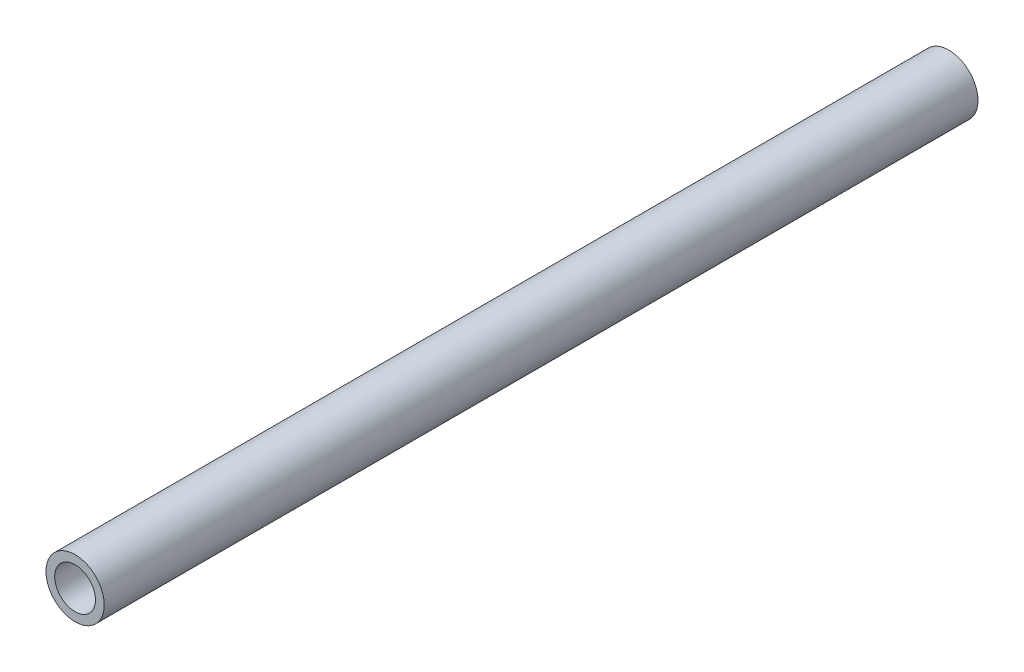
ISO-10303-21;
HEADER;
FILE_DESCRIPTION(('STEP AP214'),'2;1');
FILE_NAME('part.step','',(''),(''),'','','');
FILE_SCHEMA(('AUTOMOTIVE_DESIGN { 1 0 10303 214 1 1 1 1 }'));
ENDSEC;
DATA;
#1=APPLICATION_CONTEXT('core data for automotive mechanical design processes');
#2=APPLICATION_PROTOCOL_DEFINITION('international standard','automotive_design',2000,#1);
#3=PRODUCT_CONTEXT('',#1,'mechanical');
#4=PRODUCT('Part','Part','',(#3));
#5=PRODUCT_RELATED_PRODUCT_CATEGORY('part','',(#4));
#6=PRODUCT_DEFINITION_FORMATION('','',#4);
#7=PRODUCT_DEFINITION_CONTEXT('part definition',#1,'design');
#8=PRODUCT_DEFINITION('design','',#6,#7);
#9=PRODUCT_DEFINITION_SHAPE('','',#8);
#10=(LENGTH_UNIT() NAMED_UNIT(*) SI_UNIT(.MILLI.,.METRE.));
#11=(NAMED_UNIT(*) PLANE_ANGLE_UNIT() SI_UNIT($,.RADIAN.));
#12=(NAMED_UNIT(*) SI_UNIT($,.STERADIAN.) SOLID_ANGLE_UNIT());
#13=UNCERTAINTY_MEASURE_WITH_UNIT(LENGTH_MEASURE(1.E-05),#10,'distance_accuracy_value','');
#14=(GEOMETRIC_REPRESENTATION_CONTEXT(3) GLOBAL_UNCERTAINTY_ASSIGNED_CONTEXT((#13)) GLOBAL_UNIT_ASSIGNED_CONTEXT((#10,
#11,#12)) REPRESENTATION_CONTEXT('',''));
#15=CARTESIAN_POINT('',(0.,0.,0.));
#16=DIRECTION('',(0.,0.,1.));
#17=DIRECTION('',(1.,0.,0.));
#18=AXIS2_PLACEMENT_3D('',#15,#16,#17);
#19=CARTESIAN_POINT('',(0.,0.,300.));
#20=DIRECTION('',(0.,0.,1.));
#21=DIRECTION('',(1.,0.,0.));
#22=AXIS2_PLACEMENT_3D('',#19,#20,#21);
#23=PLANE('',#22);
#24=CARTESIAN_POINT('',(0.,0.,300.));
#25=DIRECTION('',(0.,0.,1.));
#26=DIRECTION('',(1.,0.,0.));
#27=AXIS2_PLACEMENT_3D('',#24,#25,#26);
#28=CIRCLE('',#27,10.);
#29=CARTESIAN_POINT('',(10.,0.,300.));
#30=VERTEX_POINT('',#29);
#31=EDGE_CURVE('E10',#30,#30,#28,.T.);
#32=ORIENTED_EDGE('',*,*,#31,.T.);
#33=EDGE_LOOP('',(#32));
#34=FACE_BOUND('',#33,.T.);
#35=CARTESIAN_POINT('',(0.,0.,300.));
#36=DIRECTION('',(0.,0.,1.));
#37=DIRECTION('',(1.,0.,0.));
#38=AXIS2_PLACEMENT_3D('',#35,#36,#37);
#39=CIRCLE('',#38,7.);
#40=CARTESIAN_POINT('',(7.,0.,300.));
#41=VERTEX_POINT('',#40);
#42=EDGE_CURVE('E46',#41,#41,#39,.T.);
#43=ORIENTED_EDGE('',*,*,#42,.F.);
#44=EDGE_LOOP('',(#43));
#45=FACE_BOUND('',#44,.T.);
#46=ADVANCED_FACE('F35',(#34,#45),#23,.T.);
#47=CARTESIAN_POINT('',(0.,0.,0.));
#48=DIRECTION('',(0.,0.,1.));
#49=DIRECTION('',(1.,0.,0.));
#50=AXIS2_PLACEMENT_3D('',#47,#48,#49);
#51=PLANE('',#50);
#52=CARTESIAN_POINT('',(0.,0.,0.));
#53=DIRECTION('',(0.,0.,1.));
#54=DIRECTION('',(1.,0.,0.));
#55=AXIS2_PLACEMENT_3D('',#52,#53,#54);
#56=CIRCLE('',#55,10.);
#57=CARTESIAN_POINT('',(10.,0.,0.));
#58=VERTEX_POINT('',#57);
#59=EDGE_CURVE('E39',#58,#58,#56,.T.);
#60=ORIENTED_EDGE('',*,*,#59,.F.);
#61=EDGE_LOOP('',(#60));
#62=FACE_BOUND('',#61,.T.);
#63=CARTESIAN_POINT('',(0.,0.,0.));
#64=DIRECTION('',(0.,0.,1.));
#65=DIRECTION('',(1.,0.,0.));
#66=AXIS2_PLACEMENT_3D('',#63,#64,#65);
#67=CIRCLE('',#66,7.);
#68=CARTESIAN_POINT('',(7.,0.,0.));
#69=VERTEX_POINT('',#68);
#70=EDGE_CURVE('E48',#69,#69,#67,.T.);
#71=ORIENTED_EDGE('',*,*,#70,.T.);
#72=EDGE_LOOP('',(#71));
#73=FACE_BOUND('',#72,.T.);
#74=ADVANCED_FACE('F58',(#62,#73),#51,.F.);
#75=CARTESIAN_POINT('',(0.,0.,300.));
#76=DIRECTION('',(0.,0.,-1.));
#77=DIRECTION('',(-1.,0.,0.));
#78=AXIS2_PLACEMENT_3D('',#75,#76,#77);
#79=CYLINDRICAL_SURFACE('',#78,10.);
#80=ORIENTED_EDGE('',*,*,#31,.F.);
#81=EDGE_LOOP('',(#80));
#82=FACE_BOUND('',#81,.T.);
#83=ORIENTED_EDGE('',*,*,#59,.T.);
#84=EDGE_LOOP('',(#83));
#85=FACE_BOUND('',#84,.T.);
#86=ADVANCED_FACE('F37',(#82,#85),#79,.T.);
#87=CARTESIAN_POINT('',(0.,0.,300.));
#88=DIRECTION('',(0.,0.,-1.));
#89=DIRECTION('',(-1.,0.,0.));
#90=AXIS2_PLACEMENT_3D('',#87,#88,#89);
#91=CYLINDRICAL_SURFACE('',#90,7.);
#92=ORIENTED_EDGE('',*,*,#42,.T.);
#93=EDGE_LOOP('',(#92));
#94=FACE_BOUND('',#93,.T.);
#95=ORIENTED_EDGE('',*,*,#70,.F.);
#96=EDGE_LOOP('',(#95));
#97=FACE_BOUND('',#96,.T.);
#98=ADVANCED_FACE('F54',(#94,#97),#91,.F.);
#99=CLOSED_SHELL('',(#46,#74,#86,#98));
#100=MANIFOLD_SOLID_BREP('B2',#99);
#101=ADVANCED_BREP_SHAPE_REPRESENTATION('',(#18,#100),#14);
#102=SHAPE_DEFINITION_REPRESENTATION(#9,#101);
ENDSEC;
END-ISO-10303-21;
